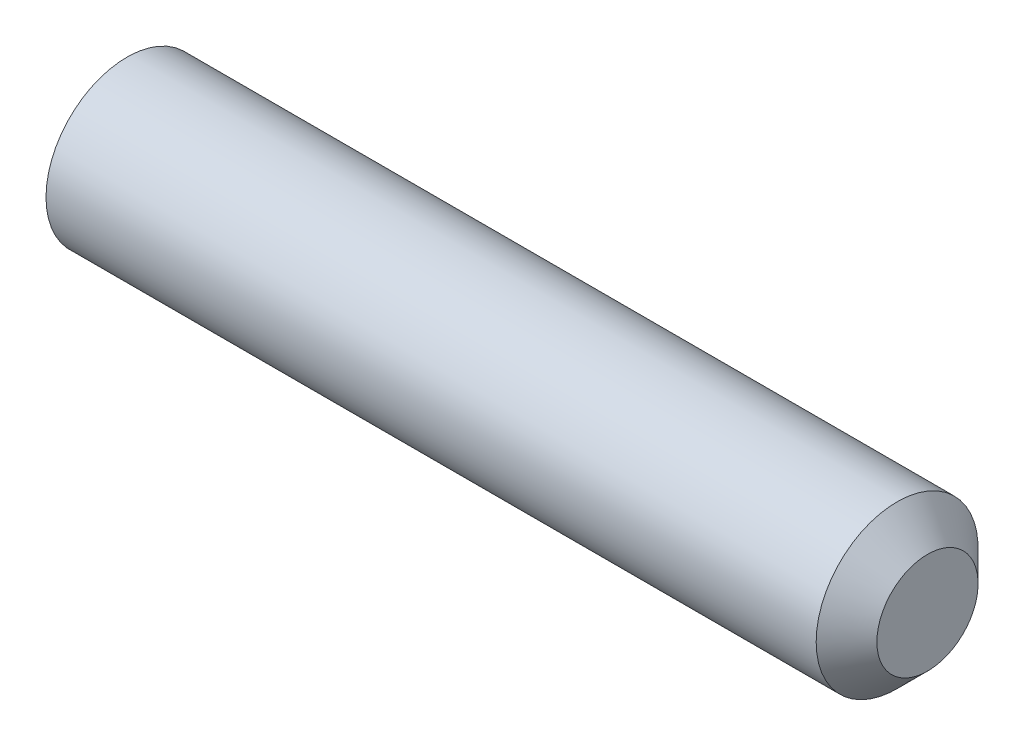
ISO-10303-21;
HEADER;
FILE_DESCRIPTION(('STEP AP214'),'2;1');
FILE_NAME('part.step','',(''),(''),'','','');
FILE_SCHEMA(('AUTOMOTIVE_DESIGN { 1 0 10303 214 1 1 1 1 }'));
ENDSEC;
DATA;
#1=APPLICATION_CONTEXT('core data for automotive mechanical design processes');
#2=APPLICATION_PROTOCOL_DEFINITION('international standard','automotive_design',2000,#1);
#3=PRODUCT_CONTEXT('',#1,'mechanical');
#4=PRODUCT('Part','Part','',(#3));
#5=PRODUCT_RELATED_PRODUCT_CATEGORY('part','',(#4));
#6=PRODUCT_DEFINITION_FORMATION('','',#4);
#7=PRODUCT_DEFINITION_CONTEXT('part definition',#1,'design');
#8=PRODUCT_DEFINITION('design','',#6,#7);
#9=PRODUCT_DEFINITION_SHAPE('','',#8);
#10=(LENGTH_UNIT() NAMED_UNIT(*) SI_UNIT(.MILLI.,.METRE.));
#11=(NAMED_UNIT(*) PLANE_ANGLE_UNIT() SI_UNIT($,.RADIAN.));
#12=(NAMED_UNIT(*) SI_UNIT($,.STERADIAN.) SOLID_ANGLE_UNIT());
#13=UNCERTAINTY_MEASURE_WITH_UNIT(LENGTH_MEASURE(1.E-05),#10,'distance_accuracy_value','');
#14=(GEOMETRIC_REPRESENTATION_CONTEXT(3) GLOBAL_UNCERTAINTY_ASSIGNED_CONTEXT((#13)) GLOBAL_UNIT_ASSIGNED_CONTEXT((#10,
#11,#12)) REPRESENTATION_CONTEXT('',''));
#15=CARTESIAN_POINT('',(0.,0.,0.));
#16=DIRECTION('',(0.,0.,1.));
#17=DIRECTION('',(1.,0.,0.));
#18=AXIS2_PLACEMENT_3D('',#15,#16,#17);
#19=CARTESIAN_POINT('',(0.,0.,0.));
#20=DIRECTION('',(-1.,0.,0.));
#21=DIRECTION('',(0.,0.,1.));
#22=AXIS2_PLACEMENT_3D('',#19,#20,#21);
#23=PLANE('',#22);
#24=CARTESIAN_POINT('',(0.,0.,0.));
#25=DIRECTION('',(-1.,0.,0.));
#26=DIRECTION('',(0.,0.,1.));
#27=AXIS2_PLACEMENT_3D('',#24,#25,#26);
#28=CIRCLE('',#27,1.61);
#29=CARTESIAN_POINT('',(0.,0.,1.61));
#30=VERTEX_POINT('',#29);
#31=EDGE_CURVE('E137',#30,#30,#28,.T.);
#32=ORIENTED_EDGE('',*,*,#31,.T.);
#33=EDGE_LOOP('',(#32));
#34=FACE_BOUND('',#33,.T.);
#35=DIRECTION('',(0.,0.,-1.));
#36=VECTOR('',#35,1.);
#37=CARTESIAN_POINT('',(0.,1.,0.577350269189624));
#38=LINE('',#37,#36);
#39=CARTESIAN_POINT('',(0.,1.,0.577350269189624));
#40=VERTEX_POINT('',#39);
#41=CARTESIAN_POINT('',(0.,1.,-0.577350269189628));
#42=VERTEX_POINT('',#41);
#43=EDGE_CURVE('E128',#40,#42,#38,.T.);
#44=ORIENTED_EDGE('',*,*,#43,.F.);
#45=DIRECTION('',(0.,-0.866025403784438,0.5));
#46=VECTOR('',#45,1.);
#47=CARTESIAN_POINT('',(0.,1.,0.577350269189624));
#48=LINE('',#47,#46);
#49=CARTESIAN_POINT('',(0.,0.,1.15470053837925));
#50=VERTEX_POINT('',#49);
#51=EDGE_CURVE('E50',#40,#50,#48,.T.);
#52=ORIENTED_EDGE('',*,*,#51,.T.);
#53=DIRECTION('',(0.,0.866025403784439,0.5));
#54=VECTOR('',#53,1.);
#55=CARTESIAN_POINT('',(0.,-0.999999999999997,0.577350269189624));
#56=LINE('',#55,#54);
#57=CARTESIAN_POINT('',(0.,-0.999999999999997,0.577350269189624));
#58=VERTEX_POINT('',#57);
#59=EDGE_CURVE('E119',#58,#50,#56,.T.);
#60=ORIENTED_EDGE('',*,*,#59,.F.);
#61=DIRECTION('',(0.,0.,-1.));
#62=VECTOR('',#61,1.);
#63=CARTESIAN_POINT('',(0.,-0.999999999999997,0.577350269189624));
#64=LINE('',#63,#62);
#65=CARTESIAN_POINT('',(0.,-0.999999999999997,-0.577350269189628));
#66=VERTEX_POINT('',#65);
#67=EDGE_CURVE('E122',#58,#66,#64,.T.);
#68=ORIENTED_EDGE('',*,*,#67,.T.);
#69=DIRECTION('',(0.,0.866025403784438,-0.500000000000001));
#70=VECTOR('',#69,1.);
#71=CARTESIAN_POINT('',(0.,-0.999999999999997,-0.577350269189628));
#72=LINE('',#71,#70);
#73=CARTESIAN_POINT('',(0.,0.,-1.15470053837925));
#74=VERTEX_POINT('',#73);
#75=EDGE_CURVE('E125',#66,#74,#72,.T.);
#76=ORIENTED_EDGE('',*,*,#75,.T.);
#77=DIRECTION('',(0.,-0.866025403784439,-0.5));
#78=VECTOR('',#77,1.);
#79=CARTESIAN_POINT('',(0.,1.,-0.577350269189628));
#80=LINE('',#79,#78);
#81=EDGE_CURVE('E108',#42,#74,#80,.T.);
#82=ORIENTED_EDGE('',*,*,#81,.F.);
#83=EDGE_LOOP('',(#44,#52,#60,#68,#76,#82));
#84=FACE_BOUND('',#83,.T.);
#85=ADVANCED_FACE('F35',(#34,#84),#23,.T.);
#86=CARTESIAN_POINT('',(20.,1.25,0.));
#87=DIRECTION('',(1.,0.,0.));
#88=DIRECTION('',(0.,0.,-1.));
#89=AXIS2_PLACEMENT_3D('',#86,#87,#88);
#90=PLANE('',#89);
#91=CARTESIAN_POINT('',(20.,0.,0.));
#92=DIRECTION('',(-1.,0.,0.));
#93=DIRECTION('',(0.,0.,1.));
#94=AXIS2_PLACEMENT_3D('',#91,#92,#93);
#95=CIRCLE('',#94,1.25);
#96=CARTESIAN_POINT('',(20.,0.,1.25));
#97=VERTEX_POINT('',#96);
#98=EDGE_CURVE('E11',#97,#97,#95,.T.);
#99=ORIENTED_EDGE('',*,*,#98,.F.);
#100=EDGE_LOOP('',(#99));
#101=FACE_BOUND('',#100,.T.);
#102=ADVANCED_FACE('F37',(#101),#90,.T.);
#103=CARTESIAN_POINT('',(19.25,0.,0.));
#104=DIRECTION('',(-1.,0.,0.));
#105=DIRECTION('',(0.,0.,1.));
#106=AXIS2_PLACEMENT_3D('',#103,#104,#105);
#107=CONICAL_SURFACE('',#106,2.,0.78539816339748);
#108=ORIENTED_EDGE('',*,*,#98,.T.);
#109=EDGE_LOOP('',(#108));
#110=FACE_BOUND('',#109,.T.);
#111=CARTESIAN_POINT('',(19.25,0.,0.));
#112=DIRECTION('',(-1.,0.,0.));
#113=DIRECTION('',(0.,0.,1.));
#114=AXIS2_PLACEMENT_3D('',#111,#112,#113);
#115=CIRCLE('',#114,2.);
#116=CARTESIAN_POINT('',(19.25,0.,2.));
#117=VERTEX_POINT('',#116);
#118=EDGE_CURVE('E43',#117,#117,#115,.T.);
#119=ORIENTED_EDGE('',*,*,#118,.F.);
#120=EDGE_LOOP('',(#119));
#121=FACE_BOUND('',#120,.T.);
#122=ADVANCED_FACE('F148',(#110,#121),#107,.T.);
#123=CARTESIAN_POINT('',(-12.7,0.,0.));
#124=DIRECTION('',(-1.,0.,0.));
#125=DIRECTION('',(0.,0.,1.));
#126=AXIS2_PLACEMENT_3D('',#123,#124,#125);
#127=CYLINDRICAL_SURFACE('',#126,2.);
#128=ORIENTED_EDGE('',*,*,#118,.T.);
#129=EDGE_LOOP('',(#128));
#130=FACE_BOUND('',#129,.T.);
#131=CARTESIAN_POINT('',(0.225166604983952,0.,0.));
#132=DIRECTION('',(-1.,0.,0.));
#133=DIRECTION('',(0.,0.,1.));
#134=AXIS2_PLACEMENT_3D('',#131,#132,#133);
#135=CIRCLE('',#134,2.);
#136=CARTESIAN_POINT('',(0.225166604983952,0.,2.));
#137=VERTEX_POINT('',#136);
#138=EDGE_CURVE('E140',#137,#137,#135,.T.);
#139=ORIENTED_EDGE('',*,*,#138,.F.);
#140=EDGE_LOOP('',(#139));
#141=FACE_BOUND('',#140,.T.);
#142=ADVANCED_FACE('F145',(#130,#141),#127,.T.);
#143=CARTESIAN_POINT('',(0.,0.,0.));
#144=DIRECTION('',(1.,0.,0.));
#145=DIRECTION('',(0.,0.,-1.));
#146=AXIS2_PLACEMENT_3D('',#143,#144,#145);
#147=CONICAL_SURFACE('',#146,1.61,1.0471975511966);
#148=ORIENTED_EDGE('',*,*,#138,.T.);
#149=EDGE_LOOP('',(#148));
#150=FACE_BOUND('',#149,.T.);
#151=ORIENTED_EDGE('',*,*,#31,.F.);
#152=EDGE_LOOP('',(#151));
#153=FACE_BOUND('',#152,.T.);
#154=ADVANCED_FACE('F155',(#150,#153),#147,.T.);
#155=CARTESIAN_POINT('',(2.5,1.,0.577350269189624));
#156=DIRECTION('',(0.,-0.5,-0.866025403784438));
#157=DIRECTION('',(0.,0.866025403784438,-0.5));
#158=AXIS2_PLACEMENT_3D('',#155,#156,#157);
#159=PLANE('',#158);
#160=ORIENTED_EDGE('',*,*,#51,.F.);
#161=DIRECTION('',(-1.,0.,0.));
#162=VECTOR('',#161,1.);
#163=CARTESIAN_POINT('',(2.5,1.,0.577350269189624));
#164=LINE('',#163,#162);
#165=CARTESIAN_POINT('',(2.5,1.,0.577350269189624));
#166=VERTEX_POINT('',#165);
#167=EDGE_CURVE('E55',#166,#40,#164,.T.);
#168=ORIENTED_EDGE('',*,*,#167,.F.);
#169=DIRECTION('',(0.,-0.866025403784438,0.5));
#170=VECTOR('',#169,1.);
#171=CARTESIAN_POINT('',(2.5,1.,0.577350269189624));
#172=LINE('',#171,#170);
#173=CARTESIAN_POINT('',(2.5,0.,1.15470053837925));
#174=VERTEX_POINT('',#173);
#175=EDGE_CURVE('E82',#166,#174,#172,.T.);
#176=ORIENTED_EDGE('',*,*,#175,.T.);
#177=DIRECTION('',(-1.,0.,0.));
#178=VECTOR('',#177,1.);
#179=CARTESIAN_POINT('',(2.5,0.,1.15470053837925));
#180=LINE('',#179,#178);
#181=EDGE_CURVE('E135',#174,#50,#180,.T.);
#182=ORIENTED_EDGE('',*,*,#181,.T.);
#183=EDGE_LOOP('',(#160,#168,#176,#182));
#184=FACE_BOUND('',#183,.T.);
#185=ADVANCED_FACE('F166',(#184),#159,.T.);
#186=CARTESIAN_POINT('',(2.5,-0.999999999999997,0.577350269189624));
#187=DIRECTION('',(0.,-0.5,0.866025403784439));
#188=DIRECTION('',(0.,-0.866025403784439,-0.5));
#189=AXIS2_PLACEMENT_3D('',#186,#187,#188);
#190=PLANE('',#189);
#191=ORIENTED_EDGE('',*,*,#59,.T.);
#192=ORIENTED_EDGE('',*,*,#181,.F.);
#193=DIRECTION('',(0.,0.866025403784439,0.5));
#194=VECTOR('',#193,1.);
#195=CARTESIAN_POINT('',(2.5,-0.999999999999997,0.577350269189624));
#196=LINE('',#195,#194);
#197=CARTESIAN_POINT('',(2.5,-0.999999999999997,0.577350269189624));
#198=VERTEX_POINT('',#197);
#199=EDGE_CURVE('E266',#198,#174,#196,.T.);
#200=ORIENTED_EDGE('',*,*,#199,.F.);
#201=DIRECTION('',(-1.,0.,0.));
#202=VECTOR('',#201,1.);
#203=CARTESIAN_POINT('',(2.5,-0.999999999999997,0.577350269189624));
#204=LINE('',#203,#202);
#205=EDGE_CURVE('E133',#198,#58,#204,.T.);
#206=ORIENTED_EDGE('',*,*,#205,.T.);
#207=EDGE_LOOP('',(#191,#192,#200,#206));
#208=FACE_BOUND('',#207,.T.);
#209=ADVANCED_FACE('F173',(#208),#190,.F.);
#210=CARTESIAN_POINT('',(2.5,-0.999999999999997,0.577350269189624));
#211=DIRECTION('',(0.,1.,0.));
#212=DIRECTION('',(0.,0.,1.));
#213=AXIS2_PLACEMENT_3D('',#210,#211,#212);
#214=PLANE('',#213);
#215=ORIENTED_EDGE('',*,*,#67,.F.);
#216=ORIENTED_EDGE('',*,*,#205,.F.);
#217=DIRECTION('',(0.,0.,-1.));
#218=VECTOR('',#217,1.);
#219=CARTESIAN_POINT('',(2.5,-0.999999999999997,0.577350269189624));
#220=LINE('',#219,#218);
#221=CARTESIAN_POINT('',(2.5,-0.999999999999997,-0.577350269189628));
#222=VERTEX_POINT('',#221);
#223=EDGE_CURVE('E103',#198,#222,#220,.T.);
#224=ORIENTED_EDGE('',*,*,#223,.T.);
#225=DIRECTION('',(-1.,0.,0.));
#226=VECTOR('',#225,1.);
#227=CARTESIAN_POINT('',(2.5,-0.999999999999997,-0.577350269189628));
#228=LINE('',#227,#226);
#229=EDGE_CURVE('E98',#222,#66,#228,.T.);
#230=ORIENTED_EDGE('',*,*,#229,.T.);
#231=EDGE_LOOP('',(#215,#216,#224,#230));
#232=FACE_BOUND('',#231,.T.);
#233=ADVANCED_FACE('F180',(#232),#214,.T.);
#234=CARTESIAN_POINT('',(2.5,-0.999999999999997,-0.577350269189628));
#235=DIRECTION('',(0.,0.500000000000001,0.866025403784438));
#236=DIRECTION('',(0.,-0.866025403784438,0.500000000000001));
#237=AXIS2_PLACEMENT_3D('',#234,#235,#236);
#238=PLANE('',#237);
#239=ORIENTED_EDGE('',*,*,#75,.F.);
#240=ORIENTED_EDGE('',*,*,#229,.F.);
#241=DIRECTION('',(0.,0.866025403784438,-0.500000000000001));
#242=VECTOR('',#241,1.);
#243=CARTESIAN_POINT('',(2.5,-0.999999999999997,-0.577350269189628));
#244=LINE('',#243,#242);
#245=CARTESIAN_POINT('',(2.5,0.,-1.15470053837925));
#246=VERTEX_POINT('',#245);
#247=EDGE_CURVE('E93',#222,#246,#244,.T.);
#248=ORIENTED_EDGE('',*,*,#247,.T.);
#249=DIRECTION('',(-1.,0.,0.));
#250=VECTOR('',#249,1.);
#251=CARTESIAN_POINT('',(2.5,0.,-1.15470053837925));
#252=LINE('',#251,#250);
#253=EDGE_CURVE('E97',#246,#74,#252,.T.);
#254=ORIENTED_EDGE('',*,*,#253,.T.);
#255=EDGE_LOOP('',(#239,#240,#248,#254));
#256=FACE_BOUND('',#255,.T.);
#257=ADVANCED_FACE('F96',(#256),#238,.T.);
#258=CARTESIAN_POINT('',(2.5,1.,-0.577350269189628));
#259=DIRECTION('',(0.,0.5,-0.866025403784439));
#260=DIRECTION('',(0.,0.866025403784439,0.5));
#261=AXIS2_PLACEMENT_3D('',#258,#259,#260);
#262=PLANE('',#261);
#263=ORIENTED_EDGE('',*,*,#81,.T.);
#264=ORIENTED_EDGE('',*,*,#253,.F.);
#265=DIRECTION('',(0.,-0.866025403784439,-0.5));
#266=VECTOR('',#265,1.);
#267=CARTESIAN_POINT('',(2.5,1.,-0.577350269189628));
#268=LINE('',#267,#266);
#269=CARTESIAN_POINT('',(2.5,1.,-0.577350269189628));
#270=VERTEX_POINT('',#269);
#271=EDGE_CURVE('E102',#270,#246,#268,.T.);
#272=ORIENTED_EDGE('',*,*,#271,.F.);
#273=DIRECTION('',(-1.,0.,0.));
#274=VECTOR('',#273,1.);
#275=CARTESIAN_POINT('',(2.5,1.,-0.577350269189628));
#276=LINE('',#275,#274);
#277=EDGE_CURVE('E78',#270,#42,#276,.T.);
#278=ORIENTED_EDGE('',*,*,#277,.T.);
#279=EDGE_LOOP('',(#263,#264,#272,#278));
#280=FACE_BOUND('',#279,.T.);
#281=ADVANCED_FACE('F105',(#280),#262,.F.);
#282=CARTESIAN_POINT('',(2.5,1.,0.577350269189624));
#283=DIRECTION('',(0.,1.,0.));
#284=DIRECTION('',(0.,0.,1.));
#285=AXIS2_PLACEMENT_3D('',#282,#283,#284);
#286=PLANE('',#285);
#287=ORIENTED_EDGE('',*,*,#43,.T.);
#288=ORIENTED_EDGE('',*,*,#277,.F.);
#289=DIRECTION('',(0.,0.,-1.));
#290=VECTOR('',#289,1.);
#291=CARTESIAN_POINT('',(2.5,1.,0.577350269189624));
#292=LINE('',#291,#290);
#293=EDGE_CURVE('E113',#166,#270,#292,.T.);
#294=ORIENTED_EDGE('',*,*,#293,.F.);
#295=ORIENTED_EDGE('',*,*,#167,.T.);
#296=EDGE_LOOP('',(#287,#288,#294,#295));
#297=FACE_BOUND('',#296,.T.);
#298=ADVANCED_FACE('F192',(#297),#286,.F.);
#299=CARTESIAN_POINT('',(2.5,0.,1.15470053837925));
#300=DIRECTION('',(-1.,0.,0.));
#301=DIRECTION('',(0.,0.,1.));
#302=AXIS2_PLACEMENT_3D('',#299,#300,#301);
#303=PLANE('',#302);
#304=ORIENTED_EDGE('',*,*,#175,.F.);
#305=ORIENTED_EDGE('',*,*,#293,.T.);
#306=ORIENTED_EDGE('',*,*,#271,.T.);
#307=ORIENTED_EDGE('',*,*,#247,.F.);
#308=ORIENTED_EDGE('',*,*,#223,.F.);
#309=ORIENTED_EDGE('',*,*,#199,.T.);
#310=EDGE_LOOP('',(#304,#305,#306,#307,#308,#309));
#311=FACE_BOUND('',#310,.T.);
#312=ADVANCED_FACE('F111',(#311),#303,.T.);
#313=CLOSED_SHELL('',(#85,#102,#122,#142,#154,#185,#209,#233,#257,#281,#298,#312));
#314=MANIFOLD_SOLID_BREP('B2',#313);
#315=ADVANCED_BREP_SHAPE_REPRESENTATION('',(#18,#314),#14);
#316=SHAPE_DEFINITION_REPRESENTATION(#9,#315);
ENDSEC;
END-ISO-10303-21;
